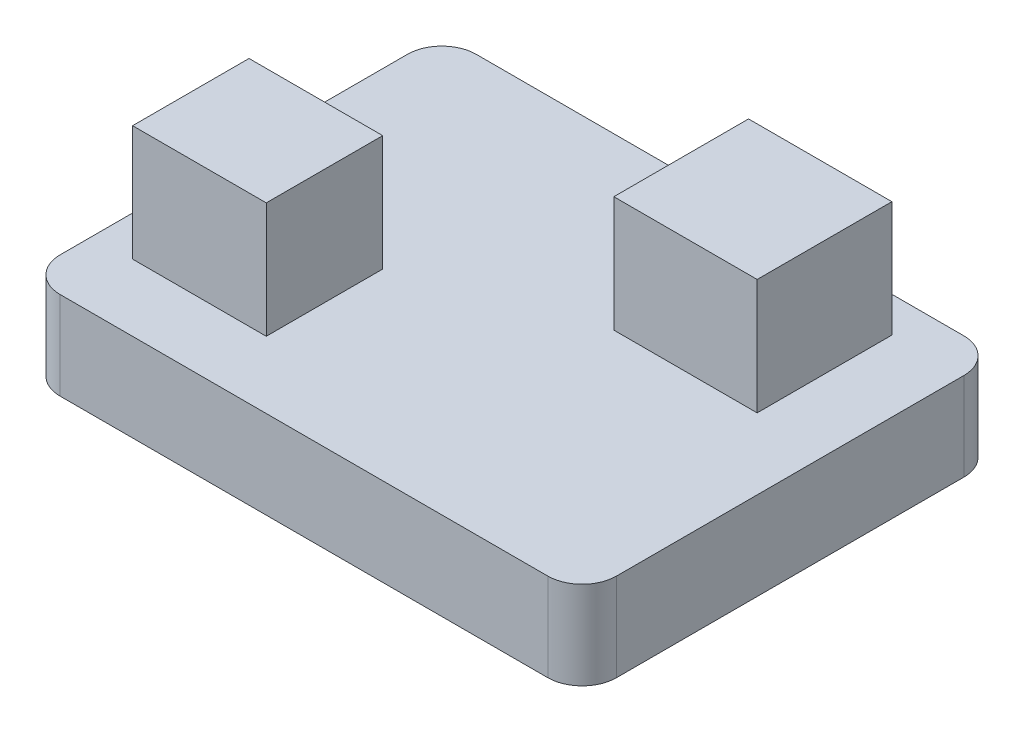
ISO-10303-21;
HEADER;
FILE_DESCRIPTION(('STEP AP214'),'2;1');
FILE_NAME('part.step','',(''),(''),'','','');
FILE_SCHEMA(('AUTOMOTIVE_DESIGN { 1 0 10303 214 1 1 1 1 }'));
ENDSEC;
DATA;
#1=APPLICATION_CONTEXT('core data for automotive mechanical design processes');
#2=APPLICATION_PROTOCOL_DEFINITION('international standard','automotive_design',2000,#1);
#3=PRODUCT_CONTEXT('',#1,'mechanical');
#4=PRODUCT('Part','Part','',(#3));
#5=PRODUCT_RELATED_PRODUCT_CATEGORY('part','',(#4));
#6=PRODUCT_DEFINITION_FORMATION('','',#4);
#7=PRODUCT_DEFINITION_CONTEXT('part definition',#1,'design');
#8=PRODUCT_DEFINITION('design','',#6,#7);
#9=PRODUCT_DEFINITION_SHAPE('','',#8);
#10=(LENGTH_UNIT() NAMED_UNIT(*) SI_UNIT(.MILLI.,.METRE.));
#11=(NAMED_UNIT(*) PLANE_ANGLE_UNIT() SI_UNIT($,.RADIAN.));
#12=(NAMED_UNIT(*) SI_UNIT($,.STERADIAN.) SOLID_ANGLE_UNIT());
#13=UNCERTAINTY_MEASURE_WITH_UNIT(LENGTH_MEASURE(1.E-05),#10,'distance_accuracy_value','');
#14=(GEOMETRIC_REPRESENTATION_CONTEXT(3) GLOBAL_UNCERTAINTY_ASSIGNED_CONTEXT((#13)) GLOBAL_UNIT_ASSIGNED_CONTEXT((#10,
#11,#12)) REPRESENTATION_CONTEXT('',''));
#15=CARTESIAN_POINT('',(0.,0.,0.));
#16=DIRECTION('',(0.,0.,1.));
#17=DIRECTION('',(1.,0.,0.));
#18=AXIS2_PLACEMENT_3D('',#15,#16,#17);
#19=CARTESIAN_POINT('',(102.733873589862,32.512,76.8270706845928));
#20=DIRECTION('',(0.,1.,0.));
#21=DIRECTION('',(0.,0.,1.));
#22=AXIS2_PLACEMENT_3D('',#19,#20,#21);
#23=PLANE('',#22);
#24=DIRECTION('',(-1.,0.,0.));
#25=VECTOR('',#24,1.);
#26=CARTESIAN_POINT('',(-87.9859958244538,32.512,9.12616024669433));
#27=LINE('',#26,#25);
#28=CARTESIAN_POINT('',(-38.6203173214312,32.512,9.12616024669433));
#29=VERTEX_POINT('',#28);
#30=CARTESIAN_POINT('',(-87.9859958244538,32.512,9.12616024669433));
#31=VERTEX_POINT('',#30);
#32=EDGE_CURVE('E176',#29,#31,#27,.T.);
#33=ORIENTED_EDGE('',*,*,#32,.F.);
#34=DIRECTION('',(0.,0.,-1.));
#35=VECTOR('',#34,1.);
#36=CARTESIAN_POINT('',(-38.6203173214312,32.512,9.12616024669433));
#37=LINE('',#36,#35);
#38=CARTESIAN_POINT('',(-38.6203173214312,32.512,52.1292089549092));
#39=VERTEX_POINT('',#38);
#40=EDGE_CURVE('E173',#39,#29,#37,.T.);
#41=ORIENTED_EDGE('',*,*,#40,.F.);
#42=DIRECTION('',(1.,0.,0.));
#43=VECTOR('',#42,1.);
#44=CARTESIAN_POINT('',(-87.9859958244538,32.512,52.1292089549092));
#45=LINE('',#44,#43);
#46=CARTESIAN_POINT('',(-87.9859958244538,32.512,52.1292089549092));
#47=VERTEX_POINT('',#46);
#48=EDGE_CURVE('E186',#47,#39,#45,.T.);
#49=ORIENTED_EDGE('',*,*,#48,.F.);
#50=DIRECTION('',(0.,0.,1.));
#51=VECTOR('',#50,1.);
#52=CARTESIAN_POINT('',(-87.9859958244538,32.512,9.12616024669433));
#53=LINE('',#52,#51);
#54=EDGE_CURVE('E194',#31,#47,#53,.T.);
#55=ORIENTED_EDGE('',*,*,#54,.F.);
#56=EDGE_LOOP('',(#33,#41,#49,#55));
#57=FACE_BOUND('',#56,.T.);
#58=DIRECTION('',(-1.,0.,0.));
#59=VECTOR('',#58,1.);
#60=CARTESIAN_POINT('',(-102.733873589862,32.512,-76.8270706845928));
#61=LINE('',#60,#59);
#62=CARTESIAN_POINT('',(90.0338735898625,32.512,-76.8270706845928));
#63=VERTEX_POINT('',#62);
#64=CARTESIAN_POINT('',(-90.0338735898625,32.512,-76.8270706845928));
#65=VERTEX_POINT('',#64);
#66=EDGE_CURVE('E211',#63,#65,#61,.T.);
#67=ORIENTED_EDGE('',*,*,#66,.T.);
#68=CARTESIAN_POINT('',(-90.0338735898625,32.512,-64.1270706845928));
#69=DIRECTION('',(0.,1.,0.));
#70=DIRECTION('',(0.,0.,1.));
#71=AXIS2_PLACEMENT_3D('',#68,#69,#70);
#72=CIRCLE('',#71,12.7);
#73=CARTESIAN_POINT('',(-102.733873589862,32.512,-64.1270706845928));
#74=VERTEX_POINT('',#73);
#75=EDGE_CURVE('E251',#65,#74,#72,.T.);
#76=ORIENTED_EDGE('',*,*,#75,.T.);
#77=DIRECTION('',(0.,0.,1.));
#78=VECTOR('',#77,1.);
#79=CARTESIAN_POINT('',(-102.733873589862,32.512,-76.8270706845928));
#80=LINE('',#79,#78);
#81=CARTESIAN_POINT('',(-102.733873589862,32.512,64.1270706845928));
#82=VERTEX_POINT('',#81);
#83=EDGE_CURVE('E215',#74,#82,#80,.T.);
#84=ORIENTED_EDGE('',*,*,#83,.T.);
#85=CARTESIAN_POINT('',(-90.0338735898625,32.512,64.1270706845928));
#86=DIRECTION('',(0.,1.,0.));
#87=DIRECTION('',(0.,0.,1.));
#88=AXIS2_PLACEMENT_3D('',#85,#86,#87);
#89=CIRCLE('',#88,12.7);
#90=CARTESIAN_POINT('',(-90.0338735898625,32.512,76.8270706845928));
#91=VERTEX_POINT('',#90);
#92=EDGE_CURVE('E55',#82,#91,#89,.T.);
#93=ORIENTED_EDGE('',*,*,#92,.T.);
#94=DIRECTION('',(1.,0.,0.));
#95=VECTOR('',#94,1.);
#96=CARTESIAN_POINT('',(-102.733873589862,32.512,76.8270706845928));
#97=LINE('',#96,#95);
#98=CARTESIAN_POINT('',(90.0338735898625,32.512,76.8270706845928));
#99=VERTEX_POINT('',#98);
#100=EDGE_CURVE('E217',#91,#99,#97,.T.);
#101=ORIENTED_EDGE('',*,*,#100,.T.);
#102=CARTESIAN_POINT('',(90.0338735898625,32.512,64.1270706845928));
#103=DIRECTION('',(0.,1.,0.));
#104=DIRECTION('',(0.,0.,1.));
#105=AXIS2_PLACEMENT_3D('',#102,#103,#104);
#106=CIRCLE('',#105,12.7);
#107=CARTESIAN_POINT('',(102.733873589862,32.512,64.1270706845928));
#108=VERTEX_POINT('',#107);
#109=EDGE_CURVE('E247',#99,#108,#106,.T.);
#110=ORIENTED_EDGE('',*,*,#109,.T.);
#111=DIRECTION('',(0.,0.,-1.));
#112=VECTOR('',#111,1.);
#113=CARTESIAN_POINT('',(102.733873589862,32.512,-76.8270706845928));
#114=LINE('',#113,#112);
#115=CARTESIAN_POINT('',(102.733873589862,32.512,-64.1270706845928));
#116=VERTEX_POINT('',#115);
#117=EDGE_CURVE('E208',#108,#116,#114,.T.);
#118=ORIENTED_EDGE('',*,*,#117,.T.);
#119=CARTESIAN_POINT('',(90.0338735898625,32.512,-64.1270706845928));
#120=DIRECTION('',(0.,1.,0.));
#121=DIRECTION('',(0.,0.,1.));
#122=AXIS2_PLACEMENT_3D('',#119,#120,#121);
#123=CIRCLE('',#122,12.7);
#124=EDGE_CURVE('E249',#116,#63,#123,.T.);
#125=ORIENTED_EDGE('',*,*,#124,.T.);
#126=EDGE_LOOP('',(#67,#76,#84,#93,#101,#110,#118,#125));
#127=FACE_BOUND('',#126,.T.);
#128=DIRECTION('',(-1.,0.,0.));
#129=VECTOR('',#128,1.);
#130=CARTESIAN_POINT('',(23.5842103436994,32.512,-63.7742353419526));
#131=LINE('',#130,#129);
#132=CARTESIAN_POINT('',(76.5126070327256,32.512,-63.7742353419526));
#133=VERTEX_POINT('',#132);
#134=CARTESIAN_POINT('',(23.5842103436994,32.512,-63.7742353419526));
#135=VERTEX_POINT('',#134);
#136=EDGE_CURVE('E481',#133,#135,#131,.T.);
#137=ORIENTED_EDGE('',*,*,#136,.F.);
#138=DIRECTION('',(0.,0.,-1.));
#139=VECTOR('',#138,1.);
#140=CARTESIAN_POINT('',(76.5126070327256,32.512,-63.7742353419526));
#141=LINE('',#140,#139);
#142=CARTESIAN_POINT('',(76.5126070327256,32.512,-14.0196039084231));
#143=VERTEX_POINT('',#142);
#144=EDGE_CURVE('E171',#143,#133,#141,.T.);
#145=ORIENTED_EDGE('',*,*,#144,.F.);
#146=DIRECTION('',(1.,0.,0.));
#147=VECTOR('',#146,1.);
#148=CARTESIAN_POINT('',(23.5842103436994,32.512,-14.0196039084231));
#149=LINE('',#148,#147);
#150=CARTESIAN_POINT('',(23.5842103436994,32.512,-14.0196039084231));
#151=VERTEX_POINT('',#150);
#152=EDGE_CURVE('E167',#151,#143,#149,.T.);
#153=ORIENTED_EDGE('',*,*,#152,.F.);
#154=DIRECTION('',(0.,0.,1.));
#155=VECTOR('',#154,1.);
#156=CARTESIAN_POINT('',(23.5842103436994,32.512,-63.7742353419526));
#157=LINE('',#156,#155);
#158=EDGE_CURVE('E479',#135,#151,#157,.T.);
#159=ORIENTED_EDGE('',*,*,#158,.F.);
#160=EDGE_LOOP('',(#137,#145,#153,#159));
#161=FACE_BOUND('',#160,.T.);
#162=ADVANCED_FACE('F35',(#57,#127,#161),#23,.T.);
#163=CARTESIAN_POINT('',(102.733873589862,32.512,-76.8270706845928));
#164=DIRECTION('',(-1.,0.,0.));
#165=DIRECTION('',(0.,0.,1.));
#166=AXIS2_PLACEMENT_3D('',#163,#164,#165);
#167=PLANE('',#166);
#168=DIRECTION('',(0.,0.,-1.));
#169=VECTOR('',#168,1.);
#170=CARTESIAN_POINT('',(102.733873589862,0.,-76.8270706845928));
#171=LINE('',#170,#169);
#172=CARTESIAN_POINT('',(102.733873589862,0.,64.1270706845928));
#173=VERTEX_POINT('',#172);
#174=CARTESIAN_POINT('',(102.733873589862,0.,-64.1270706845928));
#175=VERTEX_POINT('',#174);
#176=EDGE_CURVE('E207',#173,#175,#171,.T.);
#177=ORIENTED_EDGE('',*,*,#176,.T.);
#178=DIRECTION('',(0.,-1.,0.));
#179=VECTOR('',#178,1.);
#180=CARTESIAN_POINT('',(102.733873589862,32.512,-64.1270706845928));
#181=LINE('',#180,#179);
#182=EDGE_CURVE('E256',#175,#116,#181,.F.);
#183=ORIENTED_EDGE('',*,*,#182,.T.);
#184=ORIENTED_EDGE('',*,*,#117,.F.);
#185=DIRECTION('',(0.,-1.,0.));
#186=VECTOR('',#185,1.);
#187=CARTESIAN_POINT('',(102.733873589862,32.512,64.1270706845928));
#188=LINE('',#187,#186);
#189=EDGE_CURVE('E253',#108,#173,#188,.T.);
#190=ORIENTED_EDGE('',*,*,#189,.T.);
#191=EDGE_LOOP('',(#177,#183,#184,#190));
#192=FACE_BOUND('',#191,.T.);
#193=ADVANCED_FACE('F272',(#192),#167,.F.);
#194=CARTESIAN_POINT('',(-102.733873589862,32.512,-76.8270706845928));
#195=DIRECTION('',(0.,0.,1.));
#196=DIRECTION('',(1.,0.,0.));
#197=AXIS2_PLACEMENT_3D('',#194,#195,#196);
#198=PLANE('',#197);
#199=DIRECTION('',(-1.,0.,0.));
#200=VECTOR('',#199,1.);
#201=CARTESIAN_POINT('',(-102.733873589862,0.,-76.8270706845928));
#202=LINE('',#201,#200);
#203=CARTESIAN_POINT('',(90.0338735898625,0.,-76.8270706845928));
#204=VERTEX_POINT('',#203);
#205=CARTESIAN_POINT('',(-90.0338735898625,0.,-76.8270706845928));
#206=VERTEX_POINT('',#205);
#207=EDGE_CURVE('E222',#204,#206,#202,.T.);
#208=ORIENTED_EDGE('',*,*,#207,.T.);
#209=DIRECTION('',(0.,-1.,0.));
#210=VECTOR('',#209,1.);
#211=CARTESIAN_POINT('',(-90.0338735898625,32.512,-76.8270706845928));
#212=LINE('',#211,#210);
#213=EDGE_CURVE('E244',#206,#65,#212,.F.);
#214=ORIENTED_EDGE('',*,*,#213,.T.);
#215=ORIENTED_EDGE('',*,*,#66,.F.);
#216=DIRECTION('',(0.,-1.,0.));
#217=VECTOR('',#216,1.);
#218=CARTESIAN_POINT('',(90.0338735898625,32.512,-76.8270706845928));
#219=LINE('',#218,#217);
#220=EDGE_CURVE('E241',#63,#204,#219,.T.);
#221=ORIENTED_EDGE('',*,*,#220,.T.);
#222=EDGE_LOOP('',(#208,#214,#215,#221));
#223=FACE_BOUND('',#222,.T.);
#224=ADVANCED_FACE('F282',(#223),#198,.F.);
#225=CARTESIAN_POINT('',(-102.733873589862,32.512,-76.8270706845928));
#226=DIRECTION('',(1.,0.,0.));
#227=DIRECTION('',(0.,0.,-1.));
#228=AXIS2_PLACEMENT_3D('',#225,#226,#227);
#229=PLANE('',#228);
#230=ORIENTED_EDGE('',*,*,#83,.F.);
#231=DIRECTION('',(0.,-1.,0.));
#232=VECTOR('',#231,1.);
#233=CARTESIAN_POINT('',(-102.733873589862,32.512,-64.1270706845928));
#234=LINE('',#233,#232);
#235=CARTESIAN_POINT('',(-102.733873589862,0.,-64.1270706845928));
#236=VERTEX_POINT('',#235);
#237=EDGE_CURVE('E230',#74,#236,#234,.T.);
#238=ORIENTED_EDGE('',*,*,#237,.T.);
#239=DIRECTION('',(0.,0.,1.));
#240=VECTOR('',#239,1.);
#241=CARTESIAN_POINT('',(-102.733873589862,0.,-76.8270706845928));
#242=LINE('',#241,#240);
#243=CARTESIAN_POINT('',(-102.733873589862,0.,64.1270706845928));
#244=VERTEX_POINT('',#243);
#245=EDGE_CURVE('E225',#236,#244,#242,.T.);
#246=ORIENTED_EDGE('',*,*,#245,.T.);
#247=DIRECTION('',(0.,-1.,0.));
#248=VECTOR('',#247,1.);
#249=CARTESIAN_POINT('',(-102.733873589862,32.512,64.1270706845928));
#250=LINE('',#249,#248);
#251=EDGE_CURVE('E219',#244,#82,#250,.F.);
#252=ORIENTED_EDGE('',*,*,#251,.T.);
#253=EDGE_LOOP('',(#230,#238,#246,#252));
#254=FACE_BOUND('',#253,.T.);
#255=ADVANCED_FACE('F290',(#254),#229,.F.);
#256=CARTESIAN_POINT('',(-102.733873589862,32.512,76.8270706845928));
#257=DIRECTION('',(0.,0.,-1.));
#258=DIRECTION('',(-1.,0.,0.));
#259=AXIS2_PLACEMENT_3D('',#256,#257,#258);
#260=PLANE('',#259);
#261=DIRECTION('',(1.,0.,0.));
#262=VECTOR('',#261,1.);
#263=CARTESIAN_POINT('',(-102.733873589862,0.,76.8270706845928));
#264=LINE('',#263,#262);
#265=CARTESIAN_POINT('',(-90.0338735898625,0.,76.8270706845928));
#266=VERTEX_POINT('',#265);
#267=CARTESIAN_POINT('',(90.0338735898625,0.,76.8270706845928));
#268=VERTEX_POINT('',#267);
#269=EDGE_CURVE('E212',#266,#268,#264,.T.);
#270=ORIENTED_EDGE('',*,*,#269,.T.);
#271=DIRECTION('',(0.,-1.,0.));
#272=VECTOR('',#271,1.);
#273=CARTESIAN_POINT('',(90.0338735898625,32.512,76.8270706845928));
#274=LINE('',#273,#272);
#275=EDGE_CURVE('E11',#268,#99,#274,.F.);
#276=ORIENTED_EDGE('',*,*,#275,.T.);
#277=ORIENTED_EDGE('',*,*,#100,.F.);
#278=DIRECTION('',(0.,-1.,0.));
#279=VECTOR('',#278,1.);
#280=CARTESIAN_POINT('',(-90.0338735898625,32.512,76.8270706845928));
#281=LINE('',#280,#279);
#282=EDGE_CURVE('E43',#91,#266,#281,.T.);
#283=ORIENTED_EDGE('',*,*,#282,.T.);
#284=EDGE_LOOP('',(#270,#276,#277,#283));
#285=FACE_BOUND('',#284,.T.);
#286=ADVANCED_FACE('F260',(#285),#260,.F.);
#287=CARTESIAN_POINT('',(102.733873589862,0.,76.8270706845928));
#288=DIRECTION('',(0.,1.,0.));
#289=DIRECTION('',(0.,0.,1.));
#290=AXIS2_PLACEMENT_3D('',#287,#288,#289);
#291=PLANE('',#290);
#292=ORIENTED_EDGE('',*,*,#245,.F.);
#293=CARTESIAN_POINT('',(-90.0338735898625,0.,-64.1270706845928));
#294=DIRECTION('',(0.,1.,0.));
#295=DIRECTION('',(0.,0.,1.));
#296=AXIS2_PLACEMENT_3D('',#293,#294,#295);
#297=CIRCLE('',#296,12.7);
#298=EDGE_CURVE('E239',#236,#206,#297,.F.);
#299=ORIENTED_EDGE('',*,*,#298,.T.);
#300=ORIENTED_EDGE('',*,*,#207,.F.);
#301=CARTESIAN_POINT('',(90.0338735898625,0.,-64.1270706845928));
#302=DIRECTION('',(0.,1.,0.));
#303=DIRECTION('',(0.,0.,1.));
#304=AXIS2_PLACEMENT_3D('',#301,#302,#303);
#305=CIRCLE('',#304,12.7);
#306=EDGE_CURVE('E237',#204,#175,#305,.F.);
#307=ORIENTED_EDGE('',*,*,#306,.T.);
#308=ORIENTED_EDGE('',*,*,#176,.F.);
#309=CARTESIAN_POINT('',(90.0338735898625,0.,64.1270706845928));
#310=DIRECTION('',(0.,1.,0.));
#311=DIRECTION('',(0.,0.,1.));
#312=AXIS2_PLACEMENT_3D('',#309,#310,#311);
#313=CIRCLE('',#312,12.7);
#314=EDGE_CURVE('E235',#173,#268,#313,.F.);
#315=ORIENTED_EDGE('',*,*,#314,.T.);
#316=ORIENTED_EDGE('',*,*,#269,.F.);
#317=CARTESIAN_POINT('',(-90.0338735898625,0.,64.1270706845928));
#318=DIRECTION('',(0.,1.,0.));
#319=DIRECTION('',(0.,0.,1.));
#320=AXIS2_PLACEMENT_3D('',#317,#318,#319);
#321=CIRCLE('',#320,12.7);
#322=EDGE_CURVE('E233',#266,#244,#321,.F.);
#323=ORIENTED_EDGE('',*,*,#322,.T.);
#324=EDGE_LOOP('',(#292,#299,#300,#307,#308,#315,#316,#323));
#325=FACE_BOUND('',#324,.T.);
#326=ADVANCED_FACE('F264',(#325),#291,.F.);
#327=CARTESIAN_POINT('',(-38.6203173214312,75.184,9.12616024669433));
#328=DIRECTION('',(-1.,0.,0.));
#329=DIRECTION('',(0.,0.,1.));
#330=AXIS2_PLACEMENT_3D('',#327,#328,#329);
#331=PLANE('',#330);
#332=ORIENTED_EDGE('',*,*,#40,.T.);
#333=DIRECTION('',(0.,-1.,0.));
#334=VECTOR('',#333,1.);
#335=CARTESIAN_POINT('',(-38.6203173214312,75.184,9.12616024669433));
#336=LINE('',#335,#334);
#337=CARTESIAN_POINT('',(-38.6203173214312,75.184,9.12616024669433));
#338=VERTEX_POINT('',#337);
#339=EDGE_CURVE('E205',#338,#29,#336,.T.);
#340=ORIENTED_EDGE('',*,*,#339,.F.);
#341=DIRECTION('',(0.,0.,-1.));
#342=VECTOR('',#341,1.);
#343=CARTESIAN_POINT('',(-38.6203173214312,75.184,9.12616024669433));
#344=LINE('',#343,#342);
#345=CARTESIAN_POINT('',(-38.6203173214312,75.184,52.1292089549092));
#346=VERTEX_POINT('',#345);
#347=EDGE_CURVE('E182',#346,#338,#344,.T.);
#348=ORIENTED_EDGE('',*,*,#347,.F.);
#349=DIRECTION('',(0.,-1.,0.));
#350=VECTOR('',#349,1.);
#351=CARTESIAN_POINT('',(-38.6203173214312,75.184,52.1292089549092));
#352=LINE('',#351,#350);
#353=EDGE_CURVE('E191',#346,#39,#352,.T.);
#354=ORIENTED_EDGE('',*,*,#353,.T.);
#355=EDGE_LOOP('',(#332,#340,#348,#354));
#356=FACE_BOUND('',#355,.T.);
#357=ADVANCED_FACE('F306',(#356),#331,.F.);
#358=CARTESIAN_POINT('',(-87.9859958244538,75.184,9.12616024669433));
#359=DIRECTION('',(0.,0.,1.));
#360=DIRECTION('',(1.,0.,0.));
#361=AXIS2_PLACEMENT_3D('',#358,#359,#360);
#362=PLANE('',#361);
#363=ORIENTED_EDGE('',*,*,#32,.T.);
#364=DIRECTION('',(0.,-1.,0.));
#365=VECTOR('',#364,1.);
#366=CARTESIAN_POINT('',(-87.9859958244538,75.184,9.12616024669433));
#367=LINE('',#366,#365);
#368=CARTESIAN_POINT('',(-87.9859958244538,75.184,9.12616024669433));
#369=VERTEX_POINT('',#368);
#370=EDGE_CURVE('E202',#369,#31,#367,.T.);
#371=ORIENTED_EDGE('',*,*,#370,.F.);
#372=DIRECTION('',(-1.,0.,0.));
#373=VECTOR('',#372,1.);
#374=CARTESIAN_POINT('',(-87.9859958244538,75.184,9.12616024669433));
#375=LINE('',#374,#373);
#376=EDGE_CURVE('E185',#338,#369,#375,.T.);
#377=ORIENTED_EDGE('',*,*,#376,.F.);
#378=ORIENTED_EDGE('',*,*,#339,.T.);
#379=EDGE_LOOP('',(#363,#371,#377,#378));
#380=FACE_BOUND('',#379,.T.);
#381=ADVANCED_FACE('F406',(#380),#362,.F.);
#382=CARTESIAN_POINT('',(-87.9859958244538,75.184,9.12616024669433));
#383=DIRECTION('',(1.,0.,0.));
#384=DIRECTION('',(0.,0.,-1.));
#385=AXIS2_PLACEMENT_3D('',#382,#383,#384);
#386=PLANE('',#385);
#387=ORIENTED_EDGE('',*,*,#54,.T.);
#388=DIRECTION('',(0.,-1.,0.));
#389=VECTOR('',#388,1.);
#390=CARTESIAN_POINT('',(-87.9859958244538,75.184,52.1292089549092));
#391=LINE('',#390,#389);
#392=CARTESIAN_POINT('',(-87.9859958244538,75.184,52.1292089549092));
#393=VERTEX_POINT('',#392);
#394=EDGE_CURVE('E200',#393,#47,#391,.T.);
#395=ORIENTED_EDGE('',*,*,#394,.F.);
#396=DIRECTION('',(0.,0.,1.));
#397=VECTOR('',#396,1.);
#398=CARTESIAN_POINT('',(-87.9859958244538,75.184,9.12616024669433));
#399=LINE('',#398,#397);
#400=EDGE_CURVE('E188',#369,#393,#399,.T.);
#401=ORIENTED_EDGE('',*,*,#400,.F.);
#402=ORIENTED_EDGE('',*,*,#370,.T.);
#403=EDGE_LOOP('',(#387,#395,#401,#402));
#404=FACE_BOUND('',#403,.T.);
#405=ADVANCED_FACE('F397',(#404),#386,.F.);
#406=CARTESIAN_POINT('',(-87.9859958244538,75.184,52.1292089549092));
#407=DIRECTION('',(0.,0.,-1.));
#408=DIRECTION('',(-1.,0.,0.));
#409=AXIS2_PLACEMENT_3D('',#406,#407,#408);
#410=PLANE('',#409);
#411=ORIENTED_EDGE('',*,*,#48,.T.);
#412=ORIENTED_EDGE('',*,*,#353,.F.);
#413=DIRECTION('',(1.,0.,0.));
#414=VECTOR('',#413,1.);
#415=CARTESIAN_POINT('',(-87.9859958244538,75.184,52.1292089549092));
#416=LINE('',#415,#414);
#417=EDGE_CURVE('E190',#393,#346,#416,.T.);
#418=ORIENTED_EDGE('',*,*,#417,.F.);
#419=ORIENTED_EDGE('',*,*,#394,.T.);
#420=EDGE_LOOP('',(#411,#412,#418,#419));
#421=FACE_BOUND('',#420,.T.);
#422=ADVANCED_FACE('F388',(#421),#410,.F.);
#423=CARTESIAN_POINT('',(-38.6203173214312,75.184,52.1292089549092));
#424=DIRECTION('',(0.,1.,0.));
#425=DIRECTION('',(0.,0.,1.));
#426=AXIS2_PLACEMENT_3D('',#423,#424,#425);
#427=PLANE('',#426);
#428=ORIENTED_EDGE('',*,*,#347,.T.);
#429=ORIENTED_EDGE('',*,*,#376,.T.);
#430=ORIENTED_EDGE('',*,*,#400,.T.);
#431=ORIENTED_EDGE('',*,*,#417,.T.);
#432=EDGE_LOOP('',(#428,#429,#430,#431));
#433=FACE_BOUND('',#432,.T.);
#434=ADVANCED_FACE('F380',(#433),#427,.T.);
#435=CARTESIAN_POINT('',(76.5126070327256,75.184,-63.7742353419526));
#436=DIRECTION('',(-1.,0.,0.));
#437=DIRECTION('',(0.,0.,1.));
#438=AXIS2_PLACEMENT_3D('',#435,#436,#437);
#439=PLANE('',#438);
#440=ORIENTED_EDGE('',*,*,#144,.T.);
#441=DIRECTION('',(0.,-1.,0.));
#442=VECTOR('',#441,1.);
#443=CARTESIAN_POINT('',(76.5126070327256,75.184,-63.7742353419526));
#444=LINE('',#443,#442);
#445=CARTESIAN_POINT('',(76.5126070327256,75.184,-63.7742353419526));
#446=VERTEX_POINT('',#445);
#447=EDGE_CURVE('E151',#446,#133,#444,.T.);
#448=ORIENTED_EDGE('',*,*,#447,.F.);
#449=DIRECTION('',(0.,0.,-1.));
#450=VECTOR('',#449,1.);
#451=CARTESIAN_POINT('',(76.5126070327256,75.184,-63.7742353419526));
#452=LINE('',#451,#450);
#453=CARTESIAN_POINT('',(76.5126070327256,75.184,-14.0196039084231));
#454=VERTEX_POINT('',#453);
#455=EDGE_CURVE('E158',#454,#446,#452,.T.);
#456=ORIENTED_EDGE('',*,*,#455,.F.);
#457=DIRECTION('',(0.,-1.,0.));
#458=VECTOR('',#457,1.);
#459=CARTESIAN_POINT('',(76.5126070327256,75.184,-14.0196039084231));
#460=LINE('',#459,#458);
#461=EDGE_CURVE('E486',#454,#143,#460,.T.);
#462=ORIENTED_EDGE('',*,*,#461,.T.);
#463=EDGE_LOOP('',(#440,#448,#456,#462));
#464=FACE_BOUND('',#463,.T.);
#465=ADVANCED_FACE('F169',(#464),#439,.F.);
#466=CARTESIAN_POINT('',(23.5842103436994,75.184,-63.7742353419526));
#467=DIRECTION('',(0.,0.,1.));
#468=DIRECTION('',(1.,0.,0.));
#469=AXIS2_PLACEMENT_3D('',#466,#467,#468);
#470=PLANE('',#469);
#471=ORIENTED_EDGE('',*,*,#136,.T.);
#472=DIRECTION('',(0.,-1.,0.));
#473=VECTOR('',#472,1.);
#474=CARTESIAN_POINT('',(23.5842103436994,75.184,-63.7742353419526));
#475=LINE('',#474,#473);
#476=CARTESIAN_POINT('',(23.5842103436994,75.184,-63.7742353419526));
#477=VERTEX_POINT('',#476);
#478=EDGE_CURVE('E154',#477,#135,#475,.T.);
#479=ORIENTED_EDGE('',*,*,#478,.F.);
#480=DIRECTION('',(-1.,0.,0.));
#481=VECTOR('',#480,1.);
#482=CARTESIAN_POINT('',(23.5842103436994,75.184,-63.7742353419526));
#483=LINE('',#482,#481);
#484=EDGE_CURVE('E147',#446,#477,#483,.T.);
#485=ORIENTED_EDGE('',*,*,#484,.F.);
#486=ORIENTED_EDGE('',*,*,#447,.T.);
#487=EDGE_LOOP('',(#471,#479,#485,#486));
#488=FACE_BOUND('',#487,.T.);
#489=ADVANCED_FACE('F149',(#488),#470,.F.);
#490=CARTESIAN_POINT('',(23.5842103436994,75.184,-63.7742353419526));
#491=DIRECTION('',(1.,0.,0.));
#492=DIRECTION('',(0.,0.,-1.));
#493=AXIS2_PLACEMENT_3D('',#490,#491,#492);
#494=PLANE('',#493);
#495=ORIENTED_EDGE('',*,*,#158,.T.);
#496=DIRECTION('',(0.,-1.,0.));
#497=VECTOR('',#496,1.);
#498=CARTESIAN_POINT('',(23.5842103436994,75.184,-14.0196039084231));
#499=LINE('',#498,#497);
#500=CARTESIAN_POINT('',(23.5842103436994,75.184,-14.0196039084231));
#501=VERTEX_POINT('',#500);
#502=EDGE_CURVE('E178',#501,#151,#499,.T.);
#503=ORIENTED_EDGE('',*,*,#502,.F.);
#504=DIRECTION('',(0.,0.,1.));
#505=VECTOR('',#504,1.);
#506=CARTESIAN_POINT('',(23.5842103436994,75.184,-63.7742353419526));
#507=LINE('',#506,#505);
#508=EDGE_CURVE('E157',#477,#501,#507,.T.);
#509=ORIENTED_EDGE('',*,*,#508,.F.);
#510=ORIENTED_EDGE('',*,*,#478,.T.);
#511=EDGE_LOOP('',(#495,#503,#509,#510));
#512=FACE_BOUND('',#511,.T.);
#513=ADVANCED_FACE('F356',(#512),#494,.F.);
#514=CARTESIAN_POINT('',(23.5842103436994,75.184,-14.0196039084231));
#515=DIRECTION('',(0.,0.,-1.));
#516=DIRECTION('',(-1.,0.,0.));
#517=AXIS2_PLACEMENT_3D('',#514,#515,#516);
#518=PLANE('',#517);
#519=ORIENTED_EDGE('',*,*,#152,.T.);
#520=ORIENTED_EDGE('',*,*,#461,.F.);
#521=DIRECTION('',(1.,0.,0.));
#522=VECTOR('',#521,1.);
#523=CARTESIAN_POINT('',(23.5842103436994,75.184,-14.0196039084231));
#524=LINE('',#523,#522);
#525=EDGE_CURVE('E163',#501,#454,#524,.T.);
#526=ORIENTED_EDGE('',*,*,#525,.F.);
#527=ORIENTED_EDGE('',*,*,#502,.T.);
#528=EDGE_LOOP('',(#519,#520,#526,#527));
#529=FACE_BOUND('',#528,.T.);
#530=ADVANCED_FACE('F348',(#529),#518,.F.);
#531=CARTESIAN_POINT('',(76.5126070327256,75.184,-14.0196039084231));
#532=DIRECTION('',(0.,1.,0.));
#533=DIRECTION('',(0.,0.,1.));
#534=AXIS2_PLACEMENT_3D('',#531,#532,#533);
#535=PLANE('',#534);
#536=ORIENTED_EDGE('',*,*,#455,.T.);
#537=ORIENTED_EDGE('',*,*,#484,.T.);
#538=ORIENTED_EDGE('',*,*,#508,.T.);
#539=ORIENTED_EDGE('',*,*,#525,.T.);
#540=EDGE_LOOP('',(#536,#537,#538,#539));
#541=FACE_BOUND('',#540,.T.);
#542=ADVANCED_FACE('F161',(#541),#535,.T.);
#543=CARTESIAN_POINT('',(-90.0338735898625,32.512,-64.1270706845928));
#544=DIRECTION('',(0.,-1.,0.));
#545=DIRECTION('',(0.,0.,-1.));
#546=AXIS2_PLACEMENT_3D('',#543,#544,#545);
#547=CYLINDRICAL_SURFACE('',#546,12.7);
#548=ORIENTED_EDGE('',*,*,#75,.F.);
#549=ORIENTED_EDGE('',*,*,#213,.F.);
#550=ORIENTED_EDGE('',*,*,#298,.F.);
#551=ORIENTED_EDGE('',*,*,#237,.F.);
#552=EDGE_LOOP('',(#548,#549,#550,#551));
#553=FACE_BOUND('',#552,.T.);
#554=ADVANCED_FACE('F287',(#553),#547,.T.);
#555=CARTESIAN_POINT('',(90.0338735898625,32.512,-64.1270706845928));
#556=DIRECTION('',(0.,-1.,0.));
#557=DIRECTION('',(0.,0.,-1.));
#558=AXIS2_PLACEMENT_3D('',#555,#556,#557);
#559=CYLINDRICAL_SURFACE('',#558,12.7);
#560=ORIENTED_EDGE('',*,*,#124,.F.);
#561=ORIENTED_EDGE('',*,*,#182,.F.);
#562=ORIENTED_EDGE('',*,*,#306,.F.);
#563=ORIENTED_EDGE('',*,*,#220,.F.);
#564=EDGE_LOOP('',(#560,#561,#562,#563));
#565=FACE_BOUND('',#564,.T.);
#566=ADVANCED_FACE('F279',(#565),#559,.T.);
#567=CARTESIAN_POINT('',(90.0338735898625,32.512,64.1270706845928));
#568=DIRECTION('',(0.,-1.,0.));
#569=DIRECTION('',(0.,0.,-1.));
#570=AXIS2_PLACEMENT_3D('',#567,#568,#569);
#571=CYLINDRICAL_SURFACE('',#570,12.7);
#572=ORIENTED_EDGE('',*,*,#109,.F.);
#573=ORIENTED_EDGE('',*,*,#275,.F.);
#574=ORIENTED_EDGE('',*,*,#314,.F.);
#575=ORIENTED_EDGE('',*,*,#189,.F.);
#576=EDGE_LOOP('',(#572,#573,#574,#575));
#577=FACE_BOUND('',#576,.T.);
#578=ADVANCED_FACE('F269',(#577),#571,.T.);
#579=CARTESIAN_POINT('',(-90.0338735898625,32.512,64.1270706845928));
#580=DIRECTION('',(0.,-1.,0.));
#581=DIRECTION('',(0.,0.,-1.));
#582=AXIS2_PLACEMENT_3D('',#579,#580,#581);
#583=CYLINDRICAL_SURFACE('',#582,12.7);
#584=ORIENTED_EDGE('',*,*,#92,.F.);
#585=ORIENTED_EDGE('',*,*,#251,.F.);
#586=ORIENTED_EDGE('',*,*,#322,.F.);
#587=ORIENTED_EDGE('',*,*,#282,.F.);
#588=EDGE_LOOP('',(#584,#585,#586,#587));
#589=FACE_BOUND('',#588,.T.);
#590=ADVANCED_FACE('F37',(#589),#583,.T.);
#591=CLOSED_SHELL('',(#162,#193,#224,#255,#286,#326,#357,#381,#405,#422,#434,#465,#489,#513,
#530,#542,#554,#566,#578,#590));
#592=MANIFOLD_SOLID_BREP('B2',#591);
#593=ADVANCED_BREP_SHAPE_REPRESENTATION('',(#18,#592),#14);
#594=SHAPE_DEFINITION_REPRESENTATION(#9,#593);
ENDSEC;
END-ISO-10303-21;
